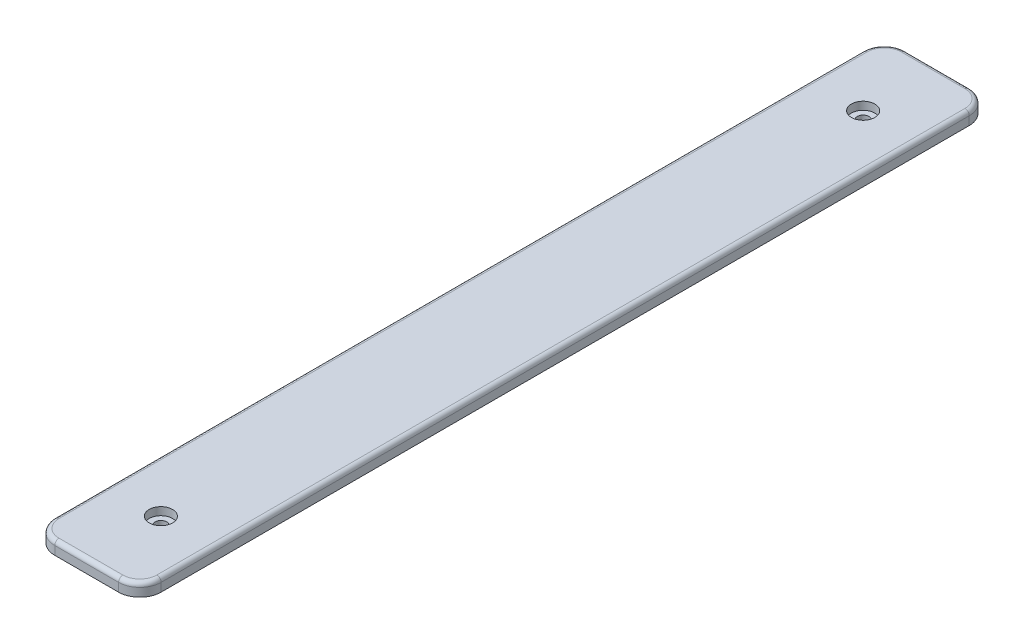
ISO-10303-21;
HEADER;
FILE_DESCRIPTION(('STEP AP214'),'2;1');
FILE_NAME('part.step','',(''),(''),'','','');
FILE_SCHEMA(('AUTOMOTIVE_DESIGN { 1 0 10303 214 1 1 1 1 }'));
ENDSEC;
DATA;
#1=APPLICATION_CONTEXT('core data for automotive mechanical design processes');
#2=APPLICATION_PROTOCOL_DEFINITION('international standard','automotive_design',2000,#1);
#3=PRODUCT_CONTEXT('',#1,'mechanical');
#4=PRODUCT('Part','Part','',(#3));
#5=PRODUCT_RELATED_PRODUCT_CATEGORY('part','',(#4));
#6=PRODUCT_DEFINITION_FORMATION('','',#4);
#7=PRODUCT_DEFINITION_CONTEXT('part definition',#1,'design');
#8=PRODUCT_DEFINITION('design','',#6,#7);
#9=PRODUCT_DEFINITION_SHAPE('','',#8);
#10=(LENGTH_UNIT() NAMED_UNIT(*) SI_UNIT(.MILLI.,.METRE.));
#11=(NAMED_UNIT(*) PLANE_ANGLE_UNIT() SI_UNIT($,.RADIAN.));
#12=(NAMED_UNIT(*) SI_UNIT($,.STERADIAN.) SOLID_ANGLE_UNIT());
#13=UNCERTAINTY_MEASURE_WITH_UNIT(LENGTH_MEASURE(1.E-05),#10,'distance_accuracy_value','');
#14=(GEOMETRIC_REPRESENTATION_CONTEXT(3) GLOBAL_UNCERTAINTY_ASSIGNED_CONTEXT((#13)) GLOBAL_UNIT_ASSIGNED_CONTEXT((#10,
#11,#12)) REPRESENTATION_CONTEXT('',''));
#15=CARTESIAN_POINT('',(0.,0.,0.));
#16=DIRECTION('',(0.,0.,1.));
#17=DIRECTION('',(1.,0.,0.));
#18=AXIS2_PLACEMENT_3D('',#15,#16,#17);
#19=CARTESIAN_POINT('',(-25.,6.,-200.));
#20=DIRECTION('',(1.,0.,0.));
#21=DIRECTION('',(0.,0.,-1.));
#22=AXIS2_PLACEMENT_3D('',#19,#20,#21);
#23=PLANE('',#22);
#24=DIRECTION('',(0.,-1.,0.));
#25=VECTOR('',#24,1.);
#26=CARTESIAN_POINT('',(-25.,6.,190.));
#27=LINE('',#26,#25);
#28=CARTESIAN_POINT('',(-25.,0.,190.));
#29=VERTEX_POINT('',#28);
#30=CARTESIAN_POINT('',(-25.,4.,190.));
#31=VERTEX_POINT('',#30);
#32=EDGE_CURVE('E132',#29,#31,#27,.F.);
#33=ORIENTED_EDGE('',*,*,#32,.T.);
#34=DIRECTION('',(0.,0.,1.));
#35=VECTOR('',#34,1.);
#36=CARTESIAN_POINT('',(-25.,4.,-190.));
#37=LINE('',#36,#35);
#38=CARTESIAN_POINT('',(-25.,4.,-190.));
#39=VERTEX_POINT('',#38);
#40=EDGE_CURVE('E11',#31,#39,#37,.F.);
#41=ORIENTED_EDGE('',*,*,#40,.T.);
#42=DIRECTION('',(0.,-1.,0.));
#43=VECTOR('',#42,1.);
#44=CARTESIAN_POINT('',(-25.,6.,-190.));
#45=LINE('',#44,#43);
#46=CARTESIAN_POINT('',(-25.,0.,-190.));
#47=VERTEX_POINT('',#46);
#48=EDGE_CURVE('E123',#39,#47,#45,.T.);
#49=ORIENTED_EDGE('',*,*,#48,.T.);
#50=DIRECTION('',(0.,0.,1.));
#51=VECTOR('',#50,1.);
#52=CARTESIAN_POINT('',(-25.,0.,-200.));
#53=LINE('',#52,#51);
#54=EDGE_CURVE('E126',#47,#29,#53,.T.);
#55=ORIENTED_EDGE('',*,*,#54,.T.);
#56=EDGE_LOOP('',(#33,#41,#49,#55));
#57=FACE_BOUND('',#56,.T.);
#58=ADVANCED_FACE('F32',(#57),#23,.F.);
#59=CARTESIAN_POINT('',(-25.,6.,200.));
#60=DIRECTION('',(0.,0.,-1.));
#61=DIRECTION('',(-1.,0.,0.));
#62=AXIS2_PLACEMENT_3D('',#59,#60,#61);
#63=PLANE('',#62);
#64=DIRECTION('',(0.,-1.,0.));
#65=VECTOR('',#64,1.);
#66=CARTESIAN_POINT('',(15.,6.,200.));
#67=LINE('',#66,#65);
#68=CARTESIAN_POINT('',(15.,0.,200.));
#69=VERTEX_POINT('',#68);
#70=CARTESIAN_POINT('',(15.,4.,200.));
#71=VERTEX_POINT('',#70);
#72=EDGE_CURVE('E177',#69,#71,#67,.F.);
#73=ORIENTED_EDGE('',*,*,#72,.T.);
#74=DIRECTION('',(1.,0.,0.));
#75=VECTOR('',#74,1.);
#76=CARTESIAN_POINT('',(-15.,4.,200.));
#77=LINE('',#76,#75);
#78=CARTESIAN_POINT('',(-15.,4.,200.));
#79=VERTEX_POINT('',#78);
#80=EDGE_CURVE('E56',#71,#79,#77,.F.);
#81=ORIENTED_EDGE('',*,*,#80,.T.);
#82=DIRECTION('',(0.,-1.,0.));
#83=VECTOR('',#82,1.);
#84=CARTESIAN_POINT('',(-15.,6.,200.));
#85=LINE('',#84,#83);
#86=CARTESIAN_POINT('',(-15.,0.,200.));
#87=VERTEX_POINT('',#86);
#88=EDGE_CURVE('E175',#79,#87,#85,.T.);
#89=ORIENTED_EDGE('',*,*,#88,.T.);
#90=DIRECTION('',(1.,0.,0.));
#91=VECTOR('',#90,1.);
#92=CARTESIAN_POINT('',(-25.,0.,200.));
#93=LINE('',#92,#91);
#94=EDGE_CURVE('E148',#87,#69,#93,.T.);
#95=ORIENTED_EDGE('',*,*,#94,.T.);
#96=EDGE_LOOP('',(#73,#81,#89,#95));
#97=FACE_BOUND('',#96,.T.);
#98=ADVANCED_FACE('F288',(#97),#63,.F.);
#99=CARTESIAN_POINT('',(25.,6.,-200.));
#100=DIRECTION('',(-1.,0.,0.));
#101=DIRECTION('',(0.,0.,1.));
#102=AXIS2_PLACEMENT_3D('',#99,#100,#101);
#103=PLANE('',#102);
#104=DIRECTION('',(0.,-1.,0.));
#105=VECTOR('',#104,1.);
#106=CARTESIAN_POINT('',(25.,6.,-190.));
#107=LINE('',#106,#105);
#108=CARTESIAN_POINT('',(25.,0.,-190.));
#109=VERTEX_POINT('',#108);
#110=CARTESIAN_POINT('',(25.,4.,-190.));
#111=VERTEX_POINT('',#110);
#112=EDGE_CURVE('E172',#109,#111,#107,.F.);
#113=ORIENTED_EDGE('',*,*,#112,.T.);
#114=DIRECTION('',(0.,0.,-1.));
#115=VECTOR('',#114,1.);
#116=CARTESIAN_POINT('',(25.,4.,190.));
#117=LINE('',#116,#115);
#118=CARTESIAN_POINT('',(25.,4.,190.));
#119=VERTEX_POINT('',#118);
#120=EDGE_CURVE('E202',#111,#119,#117,.F.);
#121=ORIENTED_EDGE('',*,*,#120,.T.);
#122=DIRECTION('',(0.,-1.,0.));
#123=VECTOR('',#122,1.);
#124=CARTESIAN_POINT('',(25.,6.,190.));
#125=LINE('',#124,#123);
#126=CARTESIAN_POINT('',(25.,0.,190.));
#127=VERTEX_POINT('',#126);
#128=EDGE_CURVE('E170',#119,#127,#125,.T.);
#129=ORIENTED_EDGE('',*,*,#128,.T.);
#130=DIRECTION('',(0.,0.,-1.));
#131=VECTOR('',#130,1.);
#132=CARTESIAN_POINT('',(25.,0.,-200.));
#133=LINE('',#132,#131);
#134=EDGE_CURVE('E152',#127,#109,#133,.T.);
#135=ORIENTED_EDGE('',*,*,#134,.T.);
#136=EDGE_LOOP('',(#113,#121,#129,#135));
#137=FACE_BOUND('',#136,.T.);
#138=ADVANCED_FACE('F282',(#137),#103,.F.);
#139=CARTESIAN_POINT('',(-25.,6.,-200.));
#140=DIRECTION('',(0.,0.,1.));
#141=DIRECTION('',(1.,0.,0.));
#142=AXIS2_PLACEMENT_3D('',#139,#140,#141);
#143=PLANE('',#142);
#144=DIRECTION('',(0.,-1.,0.));
#145=VECTOR('',#144,1.);
#146=CARTESIAN_POINT('',(-15.,6.,-200.));
#147=LINE('',#146,#145);
#148=CARTESIAN_POINT('',(-15.,0.,-200.));
#149=VERTEX_POINT('',#148);
#150=CARTESIAN_POINT('',(-15.,4.,-200.));
#151=VERTEX_POINT('',#150);
#152=EDGE_CURVE('E138',#149,#151,#147,.F.);
#153=ORIENTED_EDGE('',*,*,#152,.T.);
#154=DIRECTION('',(-1.,0.,0.));
#155=VECTOR('',#154,1.);
#156=CARTESIAN_POINT('',(15.,4.,-200.));
#157=LINE('',#156,#155);
#158=CARTESIAN_POINT('',(15.,4.,-200.));
#159=VERTEX_POINT('',#158);
#160=EDGE_CURVE('E198',#151,#159,#157,.F.);
#161=ORIENTED_EDGE('',*,*,#160,.T.);
#162=DIRECTION('',(0.,-1.,0.));
#163=VECTOR('',#162,1.);
#164=CARTESIAN_POINT('',(15.,6.,-200.));
#165=LINE('',#164,#163);
#166=CARTESIAN_POINT('',(15.,0.,-200.));
#167=VERTEX_POINT('',#166);
#168=EDGE_CURVE('E142',#159,#167,#165,.T.);
#169=ORIENTED_EDGE('',*,*,#168,.T.);
#170=DIRECTION('',(-1.,0.,0.));
#171=VECTOR('',#170,1.);
#172=CARTESIAN_POINT('',(-25.,0.,-200.));
#173=LINE('',#172,#171);
#174=EDGE_CURVE('E161',#167,#149,#173,.T.);
#175=ORIENTED_EDGE('',*,*,#174,.T.);
#176=EDGE_LOOP('',(#153,#161,#169,#175));
#177=FACE_BOUND('',#176,.T.);
#178=ADVANCED_FACE('F273',(#177),#143,.F.);
#179=CARTESIAN_POINT('',(-25.,6.,200.));
#180=DIRECTION('',(0.,1.,0.));
#181=DIRECTION('',(0.,0.,1.));
#182=AXIS2_PLACEMENT_3D('',#179,#180,#181);
#183=PLANE('',#182);
#184=DIRECTION('',(-1.,0.,0.));
#185=VECTOR('',#184,1.);
#186=CARTESIAN_POINT('',(-15.,6.,-198.));
#187=LINE('',#186,#185);
#188=CARTESIAN_POINT('',(15.,6.,-198.));
#189=VERTEX_POINT('',#188);
#190=CARTESIAN_POINT('',(-15.,6.,-198.));
#191=VERTEX_POINT('',#190);
#192=EDGE_CURVE('E191',#189,#191,#187,.T.);
#193=ORIENTED_EDGE('',*,*,#192,.T.);
#194=CARTESIAN_POINT('',(-15.,6.,-190.));
#195=DIRECTION('',(0.,1.,0.));
#196=DIRECTION('',(0.,0.,1.));
#197=AXIS2_PLACEMENT_3D('',#194,#195,#196);
#198=CIRCLE('',#197,8.);
#199=CARTESIAN_POINT('',(-23.,6.,-190.));
#200=VERTEX_POINT('',#199);
#201=EDGE_CURVE('E193',#191,#200,#198,.T.);
#202=ORIENTED_EDGE('',*,*,#201,.T.);
#203=DIRECTION('',(0.,0.,1.));
#204=VECTOR('',#203,1.);
#205=CARTESIAN_POINT('',(-23.,6.,190.));
#206=LINE('',#205,#204);
#207=CARTESIAN_POINT('',(-23.,6.,190.));
#208=VERTEX_POINT('',#207);
#209=EDGE_CURVE('E179',#200,#208,#206,.T.);
#210=ORIENTED_EDGE('',*,*,#209,.T.);
#211=CARTESIAN_POINT('',(-15.,6.,190.));
#212=DIRECTION('',(0.,1.,0.));
#213=DIRECTION('',(0.,0.,1.));
#214=AXIS2_PLACEMENT_3D('',#211,#212,#213);
#215=CIRCLE('',#214,8.);
#216=CARTESIAN_POINT('',(-15.,6.,198.));
#217=VERTEX_POINT('',#216);
#218=EDGE_CURVE('E181',#208,#217,#215,.T.);
#219=ORIENTED_EDGE('',*,*,#218,.T.);
#220=DIRECTION('',(1.,0.,0.));
#221=VECTOR('',#220,1.);
#222=CARTESIAN_POINT('',(15.,6.,198.));
#223=LINE('',#222,#221);
#224=CARTESIAN_POINT('',(15.,6.,198.));
#225=VERTEX_POINT('',#224);
#226=EDGE_CURVE('E183',#217,#225,#223,.T.);
#227=ORIENTED_EDGE('',*,*,#226,.T.);
#228=CARTESIAN_POINT('',(15.,6.,190.));
#229=DIRECTION('',(0.,1.,0.));
#230=DIRECTION('',(0.,0.,1.));
#231=AXIS2_PLACEMENT_3D('',#228,#229,#230);
#232=CIRCLE('',#231,8.);
#233=CARTESIAN_POINT('',(23.,6.,190.));
#234=VERTEX_POINT('',#233);
#235=EDGE_CURVE('E185',#225,#234,#232,.T.);
#236=ORIENTED_EDGE('',*,*,#235,.T.);
#237=DIRECTION('',(0.,0.,-1.));
#238=VECTOR('',#237,1.);
#239=CARTESIAN_POINT('',(23.,6.,-190.));
#240=LINE('',#239,#238);
#241=CARTESIAN_POINT('',(23.,6.,-190.));
#242=VERTEX_POINT('',#241);
#243=EDGE_CURVE('E187',#234,#242,#240,.T.);
#244=ORIENTED_EDGE('',*,*,#243,.T.);
#245=CARTESIAN_POINT('',(15.,6.,-190.));
#246=DIRECTION('',(0.,1.,0.));
#247=DIRECTION('',(0.,0.,1.));
#248=AXIS2_PLACEMENT_3D('',#245,#246,#247);
#249=CIRCLE('',#248,8.);
#250=EDGE_CURVE('E189',#242,#189,#249,.T.);
#251=ORIENTED_EDGE('',*,*,#250,.T.);
#252=EDGE_LOOP('',(#193,#202,#210,#219,#227,#236,#244,#251));
#253=FACE_BOUND('',#252,.T.);
#254=CARTESIAN_POINT('',(0.,6.,165.1));
#255=DIRECTION('',(0.,1.,0.));
#256=DIRECTION('',(0.,0.,1.));
#257=AXIS2_PLACEMENT_3D('',#254,#255,#256);
#258=CIRCLE('',#257,5.5);
#259=CARTESIAN_POINT('',(0.,6.,170.6));
#260=VERTEX_POINT('',#259);
#261=EDGE_CURVE('E229',#260,#260,#258,.T.);
#262=ORIENTED_EDGE('',*,*,#261,.F.);
#263=EDGE_LOOP('',(#262));
#264=FACE_BOUND('',#263,.T.);
#265=CARTESIAN_POINT('',(0.,6.,-165.1));
#266=DIRECTION('',(0.,1.,0.));
#267=DIRECTION('',(0.,0.,1.));
#268=AXIS2_PLACEMENT_3D('',#265,#266,#267);
#269=CIRCLE('',#268,5.5);
#270=CARTESIAN_POINT('',(0.,6.,-159.6));
#271=VERTEX_POINT('',#270);
#272=EDGE_CURVE('E248',#271,#271,#269,.T.);
#273=ORIENTED_EDGE('',*,*,#272,.F.);
#274=EDGE_LOOP('',(#273));
#275=FACE_BOUND('',#274,.T.);
#276=ADVANCED_FACE('F271',(#253,#264,#275),#183,.T.);
#277=CARTESIAN_POINT('',(-25.,0.,200.));
#278=DIRECTION('',(0.,1.,0.));
#279=DIRECTION('',(0.,0.,1.));
#280=AXIS2_PLACEMENT_3D('',#277,#278,#279);
#281=PLANE('',#280);
#282=CARTESIAN_POINT('',(0.,0.,165.1));
#283=DIRECTION('',(0.,1.,0.));
#284=DIRECTION('',(0.,0.,1.));
#285=AXIS2_PLACEMENT_3D('',#282,#283,#284);
#286=CIRCLE('',#285,2.75);
#287=CARTESIAN_POINT('',(0.,0.,167.85));
#288=VERTEX_POINT('',#287);
#289=EDGE_CURVE('E245',#288,#288,#286,.T.);
#290=ORIENTED_EDGE('',*,*,#289,.T.);
#291=EDGE_LOOP('',(#290));
#292=FACE_BOUND('',#291,.T.);
#293=CARTESIAN_POINT('',(0.,0.,-165.1));
#294=DIRECTION('',(0.,1.,0.));
#295=DIRECTION('',(0.,0.,1.));
#296=AXIS2_PLACEMENT_3D('',#293,#294,#295);
#297=CIRCLE('',#296,2.75);
#298=CARTESIAN_POINT('',(0.,0.,-162.35));
#299=VERTEX_POINT('',#298);
#300=EDGE_CURVE('E149',#299,#299,#297,.T.);
#301=ORIENTED_EDGE('',*,*,#300,.T.);
#302=EDGE_LOOP('',(#301));
#303=FACE_BOUND('',#302,.T.);
#304=ORIENTED_EDGE('',*,*,#54,.F.);
#305=CARTESIAN_POINT('',(-15.,0.,-190.));
#306=DIRECTION('',(0.,1.,0.));
#307=DIRECTION('',(0.,0.,1.));
#308=AXIS2_PLACEMENT_3D('',#305,#306,#307);
#309=CIRCLE('',#308,10.);
#310=EDGE_CURVE('E135',#47,#149,#309,.F.);
#311=ORIENTED_EDGE('',*,*,#310,.T.);
#312=ORIENTED_EDGE('',*,*,#174,.F.);
#313=CARTESIAN_POINT('',(15.,0.,-190.));
#314=DIRECTION('',(0.,1.,0.));
#315=DIRECTION('',(0.,0.,1.));
#316=AXIS2_PLACEMENT_3D('',#313,#314,#315);
#317=CIRCLE('',#316,10.);
#318=EDGE_CURVE('E143',#167,#109,#317,.F.);
#319=ORIENTED_EDGE('',*,*,#318,.T.);
#320=ORIENTED_EDGE('',*,*,#134,.F.);
#321=CARTESIAN_POINT('',(15.,0.,190.));
#322=DIRECTION('',(0.,1.,0.));
#323=DIRECTION('',(0.,0.,1.));
#324=AXIS2_PLACEMENT_3D('',#321,#322,#323);
#325=CIRCLE('',#324,10.);
#326=EDGE_CURVE('E165',#127,#69,#325,.F.);
#327=ORIENTED_EDGE('',*,*,#326,.T.);
#328=ORIENTED_EDGE('',*,*,#94,.F.);
#329=CARTESIAN_POINT('',(-15.,0.,190.));
#330=DIRECTION('',(0.,1.,0.));
#331=DIRECTION('',(0.,0.,1.));
#332=AXIS2_PLACEMENT_3D('',#329,#330,#331);
#333=CIRCLE('',#332,10.);
#334=EDGE_CURVE('E131',#87,#29,#333,.F.);
#335=ORIENTED_EDGE('',*,*,#334,.T.);
#336=EDGE_LOOP('',(#304,#311,#312,#319,#320,#327,#328,#335));
#337=FACE_BOUND('',#336,.T.);
#338=ADVANCED_FACE('F145',(#292,#303,#337),#281,.F.);
#339=CARTESIAN_POINT('',(0.,6.,-165.1));
#340=DIRECTION('',(0.,1.,0.));
#341=DIRECTION('',(0.,0.,1.));
#342=AXIS2_PLACEMENT_3D('',#339,#340,#341);
#343=CYLINDRICAL_SURFACE('',#342,2.75);
#344=ORIENTED_EDGE('',*,*,#300,.F.);
#345=EDGE_LOOP('',(#344));
#346=FACE_BOUND('',#345,.T.);
#347=CARTESIAN_POINT('',(0.,2.3,-165.1));
#348=DIRECTION('',(0.,1.,0.));
#349=DIRECTION('',(0.,0.,1.));
#350=AXIS2_PLACEMENT_3D('',#347,#348,#349);
#351=CIRCLE('',#350,2.75);
#352=CARTESIAN_POINT('',(0.,2.3,-162.35));
#353=VERTEX_POINT('',#352);
#354=EDGE_CURVE('E155',#353,#353,#351,.T.);
#355=ORIENTED_EDGE('',*,*,#354,.T.);
#356=EDGE_LOOP('',(#355));
#357=FACE_BOUND('',#356,.T.);
#358=ADVANCED_FACE('F256',(#346,#357),#343,.F.);
#359=CARTESIAN_POINT('',(2.74999999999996,2.3,-165.1));
#360=DIRECTION('',(0.,-1.,0.));
#361=DIRECTION('',(0.,0.,-1.));
#362=AXIS2_PLACEMENT_3D('',#359,#360,#361);
#363=PLANE('',#362);
#364=ORIENTED_EDGE('',*,*,#354,.F.);
#365=EDGE_LOOP('',(#364));
#366=FACE_BOUND('',#365,.T.);
#367=CARTESIAN_POINT('',(0.,2.3,-165.1));
#368=DIRECTION('',(0.,1.,0.));
#369=DIRECTION('',(0.,0.,1.));
#370=AXIS2_PLACEMENT_3D('',#367,#368,#369);
#371=CIRCLE('',#370,5.5);
#372=CARTESIAN_POINT('',(0.,2.3,-159.6));
#373=VERTEX_POINT('',#372);
#374=EDGE_CURVE('E251',#373,#373,#371,.T.);
#375=ORIENTED_EDGE('',*,*,#374,.T.);
#376=EDGE_LOOP('',(#375));
#377=FACE_BOUND('',#376,.T.);
#378=ADVANCED_FACE('F258',(#366,#377),#363,.F.);
#379=CARTESIAN_POINT('',(0.,6.,-165.1));
#380=DIRECTION('',(0.,1.,0.));
#381=DIRECTION('',(0.,0.,1.));
#382=AXIS2_PLACEMENT_3D('',#379,#380,#381);
#383=CYLINDRICAL_SURFACE('',#382,5.5);
#384=ORIENTED_EDGE('',*,*,#374,.F.);
#385=EDGE_LOOP('',(#384));
#386=FACE_BOUND('',#385,.T.);
#387=ORIENTED_EDGE('',*,*,#272,.T.);
#388=EDGE_LOOP('',(#387));
#389=FACE_BOUND('',#388,.T.);
#390=ADVANCED_FACE('F261',(#386,#389),#383,.F.);
#391=CARTESIAN_POINT('',(0.,6.,165.1));
#392=DIRECTION('',(0.,1.,0.));
#393=DIRECTION('',(0.,0.,1.));
#394=AXIS2_PLACEMENT_3D('',#391,#392,#393);
#395=CYLINDRICAL_SURFACE('',#394,2.75);
#396=ORIENTED_EDGE('',*,*,#289,.F.);
#397=EDGE_LOOP('',(#396));
#398=FACE_BOUND('',#397,.T.);
#399=CARTESIAN_POINT('',(0.,2.3,165.1));
#400=DIRECTION('',(0.,1.,0.));
#401=DIRECTION('',(0.,0.,1.));
#402=AXIS2_PLACEMENT_3D('',#399,#400,#401);
#403=CIRCLE('',#402,2.75);
#404=CARTESIAN_POINT('',(0.,2.3,167.85));
#405=VERTEX_POINT('',#404);
#406=EDGE_CURVE('E240',#405,#405,#403,.T.);
#407=ORIENTED_EDGE('',*,*,#406,.T.);
#408=EDGE_LOOP('',(#407));
#409=FACE_BOUND('',#408,.T.);
#410=ADVANCED_FACE('F267',(#398,#409),#395,.F.);
#411=CARTESIAN_POINT('',(2.74999999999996,2.3,165.1));
#412=DIRECTION('',(0.,-1.,0.));
#413=DIRECTION('',(0.,0.,-1.));
#414=AXIS2_PLACEMENT_3D('',#411,#412,#413);
#415=PLANE('',#414);
#416=ORIENTED_EDGE('',*,*,#406,.F.);
#417=EDGE_LOOP('',(#416));
#418=FACE_BOUND('',#417,.T.);
#419=CARTESIAN_POINT('',(0.,2.3,165.1));
#420=DIRECTION('',(0.,1.,0.));
#421=DIRECTION('',(0.,0.,1.));
#422=AXIS2_PLACEMENT_3D('',#419,#420,#421);
#423=CIRCLE('',#422,5.5);
#424=CARTESIAN_POINT('',(0.,2.3,170.6));
#425=VERTEX_POINT('',#424);
#426=EDGE_CURVE('E235',#425,#425,#423,.T.);
#427=ORIENTED_EDGE('',*,*,#426,.T.);
#428=EDGE_LOOP('',(#427));
#429=FACE_BOUND('',#428,.T.);
#430=ADVANCED_FACE('F454',(#418,#429),#415,.F.);
#431=CARTESIAN_POINT('',(0.,6.,165.1));
#432=DIRECTION('',(0.,1.,0.));
#433=DIRECTION('',(0.,0.,1.));
#434=AXIS2_PLACEMENT_3D('',#431,#432,#433);
#435=CYLINDRICAL_SURFACE('',#434,5.5);
#436=ORIENTED_EDGE('',*,*,#426,.F.);
#437=EDGE_LOOP('',(#436));
#438=FACE_BOUND('',#437,.T.);
#439=ORIENTED_EDGE('',*,*,#261,.T.);
#440=EDGE_LOOP('',(#439));
#441=FACE_BOUND('',#440,.T.);
#442=ADVANCED_FACE('F299',(#438,#441),#435,.F.);
#443=CARTESIAN_POINT('',(-15.,6.,-190.));
#444=DIRECTION('',(0.,-1.,0.));
#445=DIRECTION('',(0.,0.,-1.));
#446=AXIS2_PLACEMENT_3D('',#443,#444,#445);
#447=CYLINDRICAL_SURFACE('',#446,10.);
#448=ORIENTED_EDGE('',*,*,#48,.F.);
#449=CARTESIAN_POINT('',(-15.,4.,-190.));
#450=DIRECTION('',(0.,1.,0.));
#451=DIRECTION('',(0.,0.,1.));
#452=AXIS2_PLACEMENT_3D('',#449,#450,#451);
#453=CIRCLE('',#452,10.);
#454=EDGE_CURVE('E196',#39,#151,#453,.F.);
#455=ORIENTED_EDGE('',*,*,#454,.T.);
#456=ORIENTED_EDGE('',*,*,#152,.F.);
#457=ORIENTED_EDGE('',*,*,#310,.F.);
#458=EDGE_LOOP('',(#448,#455,#456,#457));
#459=FACE_BOUND('',#458,.T.);
#460=ADVANCED_FACE('F136',(#459),#447,.T.);
#461=CARTESIAN_POINT('',(15.,6.,-190.));
#462=DIRECTION('',(0.,-1.,0.));
#463=DIRECTION('',(0.,0.,-1.));
#464=AXIS2_PLACEMENT_3D('',#461,#462,#463);
#465=CYLINDRICAL_SURFACE('',#464,10.);
#466=ORIENTED_EDGE('',*,*,#168,.F.);
#467=CARTESIAN_POINT('',(15.,4.,-190.));
#468=DIRECTION('',(0.,1.,0.));
#469=DIRECTION('',(0.,0.,1.));
#470=AXIS2_PLACEMENT_3D('',#467,#468,#469);
#471=CIRCLE('',#470,10.);
#472=EDGE_CURVE('E200',#159,#111,#471,.F.);
#473=ORIENTED_EDGE('',*,*,#472,.T.);
#474=ORIENTED_EDGE('',*,*,#112,.F.);
#475=ORIENTED_EDGE('',*,*,#318,.F.);
#476=EDGE_LOOP('',(#466,#473,#474,#475));
#477=FACE_BOUND('',#476,.T.);
#478=ADVANCED_FACE('F298',(#477),#465,.T.);
#479=CARTESIAN_POINT('',(15.,6.,190.));
#480=DIRECTION('',(0.,-1.,0.));
#481=DIRECTION('',(0.,0.,-1.));
#482=AXIS2_PLACEMENT_3D('',#479,#480,#481);
#483=CYLINDRICAL_SURFACE('',#482,10.);
#484=ORIENTED_EDGE('',*,*,#128,.F.);
#485=CARTESIAN_POINT('',(15.,4.,190.));
#486=DIRECTION('',(0.,1.,0.));
#487=DIRECTION('',(0.,0.,1.));
#488=AXIS2_PLACEMENT_3D('',#485,#486,#487);
#489=CIRCLE('',#488,10.);
#490=EDGE_CURVE('E204',#119,#71,#489,.F.);
#491=ORIENTED_EDGE('',*,*,#490,.T.);
#492=ORIENTED_EDGE('',*,*,#72,.F.);
#493=ORIENTED_EDGE('',*,*,#326,.F.);
#494=EDGE_LOOP('',(#484,#491,#492,#493));
#495=FACE_BOUND('',#494,.T.);
#496=ADVANCED_FACE('F302',(#495),#483,.T.);
#497=CARTESIAN_POINT('',(-15.,6.,190.));
#498=DIRECTION('',(0.,-1.,0.));
#499=DIRECTION('',(0.,0.,-1.));
#500=AXIS2_PLACEMENT_3D('',#497,#498,#499);
#501=CYLINDRICAL_SURFACE('',#500,10.);
#502=ORIENTED_EDGE('',*,*,#88,.F.);
#503=CARTESIAN_POINT('',(-15.,4.,190.));
#504=DIRECTION('',(0.,1.,0.));
#505=DIRECTION('',(0.,0.,1.));
#506=AXIS2_PLACEMENT_3D('',#503,#504,#505);
#507=CIRCLE('',#506,10.);
#508=EDGE_CURVE('E41',#79,#31,#507,.F.);
#509=ORIENTED_EDGE('',*,*,#508,.T.);
#510=ORIENTED_EDGE('',*,*,#32,.F.);
#511=ORIENTED_EDGE('',*,*,#334,.F.);
#512=EDGE_LOOP('',(#502,#509,#510,#511));
#513=FACE_BOUND('',#512,.T.);
#514=ADVANCED_FACE('F306',(#513),#501,.T.);
#515=CARTESIAN_POINT('',(15.,4.,190.));
#516=DIRECTION('',(0.,1.,0.));
#517=DIRECTION('',(0.,0.,1.));
#518=AXIS2_PLACEMENT_3D('',#515,#516,#517);
#519=TOROIDAL_SURFACE('',#518,8.,2.);
#520=CARTESIAN_POINT('',(15.,4.,198.));
#521=DIRECTION('',(-1.,0.,0.));
#522=DIRECTION('',(0.,0.,1.));
#523=AXIS2_PLACEMENT_3D('',#520,#521,#522);
#524=CIRCLE('',#523,2.);
#525=EDGE_CURVE('E223',#71,#225,#524,.T.);
#526=ORIENTED_EDGE('',*,*,#525,.F.);
#527=ORIENTED_EDGE('',*,*,#490,.F.);
#528=CARTESIAN_POINT('',(23.,4.,190.));
#529=DIRECTION('',(0.,0.,-1.));
#530=DIRECTION('',(-1.,0.,0.));
#531=AXIS2_PLACEMENT_3D('',#528,#529,#530);
#532=CIRCLE('',#531,2.);
#533=EDGE_CURVE('E36',#234,#119,#532,.T.);
#534=ORIENTED_EDGE('',*,*,#533,.F.);
#535=ORIENTED_EDGE('',*,*,#235,.F.);
#536=EDGE_LOOP('',(#526,#527,#534,#535));
#537=FACE_BOUND('',#536,.T.);
#538=ADVANCED_FACE('F34',(#537),#519,.T.);
#539=CARTESIAN_POINT('',(23.,4.,200.));
#540=DIRECTION('',(0.,0.,1.));
#541=DIRECTION('',(1.,0.,0.));
#542=AXIS2_PLACEMENT_3D('',#539,#540,#541);
#543=CYLINDRICAL_SURFACE('',#542,2.);
#544=ORIENTED_EDGE('',*,*,#533,.T.);
#545=ORIENTED_EDGE('',*,*,#120,.F.);
#546=CARTESIAN_POINT('',(23.,4.,-190.));
#547=DIRECTION('',(0.,0.,-1.));
#548=DIRECTION('',(-1.,0.,0.));
#549=AXIS2_PLACEMENT_3D('',#546,#547,#548);
#550=CIRCLE('',#549,2.);
#551=EDGE_CURVE('E221',#242,#111,#550,.T.);
#552=ORIENTED_EDGE('',*,*,#551,.F.);
#553=ORIENTED_EDGE('',*,*,#243,.F.);
#554=EDGE_LOOP('',(#544,#545,#552,#553));
#555=FACE_BOUND('',#554,.T.);
#556=ADVANCED_FACE('F332',(#555),#543,.T.);
#557=CARTESIAN_POINT('',(-25.,4.,198.));
#558=DIRECTION('',(-1.,0.,0.));
#559=DIRECTION('',(0.,0.,1.));
#560=AXIS2_PLACEMENT_3D('',#557,#558,#559);
#561=CYLINDRICAL_SURFACE('',#560,2.);
#562=ORIENTED_EDGE('',*,*,#525,.T.);
#563=ORIENTED_EDGE('',*,*,#226,.F.);
#564=CARTESIAN_POINT('',(-15.,4.,198.));
#565=DIRECTION('',(-1.,0.,0.));
#566=DIRECTION('',(0.,0.,1.));
#567=AXIS2_PLACEMENT_3D('',#564,#565,#566);
#568=CIRCLE('',#567,2.);
#569=EDGE_CURVE('E218',#79,#217,#568,.T.);
#570=ORIENTED_EDGE('',*,*,#569,.F.);
#571=ORIENTED_EDGE('',*,*,#80,.F.);
#572=EDGE_LOOP('',(#562,#563,#570,#571));
#573=FACE_BOUND('',#572,.T.);
#574=ADVANCED_FACE('F329',(#573),#561,.T.);
#575=CARTESIAN_POINT('',(15.,4.,-190.));
#576=DIRECTION('',(0.,1.,0.));
#577=DIRECTION('',(0.,0.,1.));
#578=AXIS2_PLACEMENT_3D('',#575,#576,#577);
#579=TOROIDAL_SURFACE('',#578,8.,2.);
#580=ORIENTED_EDGE('',*,*,#551,.T.);
#581=ORIENTED_EDGE('',*,*,#472,.F.);
#582=CARTESIAN_POINT('',(15.,4.,-198.));
#583=DIRECTION('',(-1.,0.,0.));
#584=DIRECTION('',(0.,0.,1.));
#585=AXIS2_PLACEMENT_3D('',#582,#583,#584);
#586=CIRCLE('',#585,2.);
#587=EDGE_CURVE('E215',#189,#159,#586,.T.);
#588=ORIENTED_EDGE('',*,*,#587,.F.);
#589=ORIENTED_EDGE('',*,*,#250,.F.);
#590=EDGE_LOOP('',(#580,#581,#588,#589));
#591=FACE_BOUND('',#590,.T.);
#592=ADVANCED_FACE('F325',(#591),#579,.T.);
#593=CARTESIAN_POINT('',(-15.,4.,190.));
#594=DIRECTION('',(0.,1.,0.));
#595=DIRECTION('',(0.,0.,1.));
#596=AXIS2_PLACEMENT_3D('',#593,#594,#595);
#597=TOROIDAL_SURFACE('',#596,8.,2.);
#598=ORIENTED_EDGE('',*,*,#569,.T.);
#599=ORIENTED_EDGE('',*,*,#218,.F.);
#600=CARTESIAN_POINT('',(-23.,4.,190.));
#601=DIRECTION('',(0.,0.,-1.));
#602=DIRECTION('',(-1.,0.,0.));
#603=AXIS2_PLACEMENT_3D('',#600,#601,#602);
#604=CIRCLE('',#603,2.);
#605=EDGE_CURVE('E212',#31,#208,#604,.T.);
#606=ORIENTED_EDGE('',*,*,#605,.F.);
#607=ORIENTED_EDGE('',*,*,#508,.F.);
#608=EDGE_LOOP('',(#598,#599,#606,#607));
#609=FACE_BOUND('',#608,.T.);
#610=ADVANCED_FACE('F321',(#609),#597,.T.);
#611=CARTESIAN_POINT('',(-25.,4.,-198.));
#612=DIRECTION('',(1.,0.,0.));
#613=DIRECTION('',(0.,0.,-1.));
#614=AXIS2_PLACEMENT_3D('',#611,#612,#613);
#615=CYLINDRICAL_SURFACE('',#614,2.);
#616=ORIENTED_EDGE('',*,*,#587,.T.);
#617=ORIENTED_EDGE('',*,*,#160,.F.);
#618=CARTESIAN_POINT('',(-15.,4.,-198.));
#619=DIRECTION('',(-1.,0.,0.));
#620=DIRECTION('',(0.,0.,1.));
#621=AXIS2_PLACEMENT_3D('',#618,#619,#620);
#622=CIRCLE('',#621,2.);
#623=EDGE_CURVE('E210',#191,#151,#622,.T.);
#624=ORIENTED_EDGE('',*,*,#623,.F.);
#625=ORIENTED_EDGE('',*,*,#192,.F.);
#626=EDGE_LOOP('',(#616,#617,#624,#625));
#627=FACE_BOUND('',#626,.T.);
#628=ADVANCED_FACE('F317',(#627),#615,.T.);
#629=CARTESIAN_POINT('',(-23.,4.,200.));
#630=DIRECTION('',(0.,0.,-1.));
#631=DIRECTION('',(-1.,0.,0.));
#632=AXIS2_PLACEMENT_3D('',#629,#630,#631);
#633=CYLINDRICAL_SURFACE('',#632,2.);
#634=ORIENTED_EDGE('',*,*,#605,.T.);
#635=ORIENTED_EDGE('',*,*,#209,.F.);
#636=CARTESIAN_POINT('',(-23.,4.,-190.));
#637=DIRECTION('',(0.,0.,-1.));
#638=DIRECTION('',(-1.,0.,0.));
#639=AXIS2_PLACEMENT_3D('',#636,#637,#638);
#640=CIRCLE('',#639,2.);
#641=EDGE_CURVE('E208',#39,#200,#640,.T.);
#642=ORIENTED_EDGE('',*,*,#641,.F.);
#643=ORIENTED_EDGE('',*,*,#40,.F.);
#644=EDGE_LOOP('',(#634,#635,#642,#643));
#645=FACE_BOUND('',#644,.T.);
#646=ADVANCED_FACE('F313',(#645),#633,.T.);
#647=CARTESIAN_POINT('',(-15.,4.,-190.));
#648=DIRECTION('',(0.,1.,0.));
#649=DIRECTION('',(0.,0.,1.));
#650=AXIS2_PLACEMENT_3D('',#647,#648,#649);
#651=TOROIDAL_SURFACE('',#650,8.,2.);
#652=ORIENTED_EDGE('',*,*,#623,.T.);
#653=ORIENTED_EDGE('',*,*,#454,.F.);
#654=ORIENTED_EDGE('',*,*,#641,.T.);
#655=ORIENTED_EDGE('',*,*,#201,.F.);
#656=EDGE_LOOP('',(#652,#653,#654,#655));
#657=FACE_BOUND('',#656,.T.);
#658=ADVANCED_FACE('F310',(#657),#651,.T.);
#659=CLOSED_SHELL('',(#58,#98,#138,#178,#276,#338,#358,#378,#390,#410,#430,#442,#460,#478,#496,
#514,#538,#556,#574,#592,#610,#628,#646,#658));
#660=MANIFOLD_SOLID_BREP('B2',#659);
#661=ADVANCED_BREP_SHAPE_REPRESENTATION('',(#18,#660),#14);
#662=SHAPE_DEFINITION_REPRESENTATION(#9,#661);
ENDSEC;
END-ISO-10303-21;
